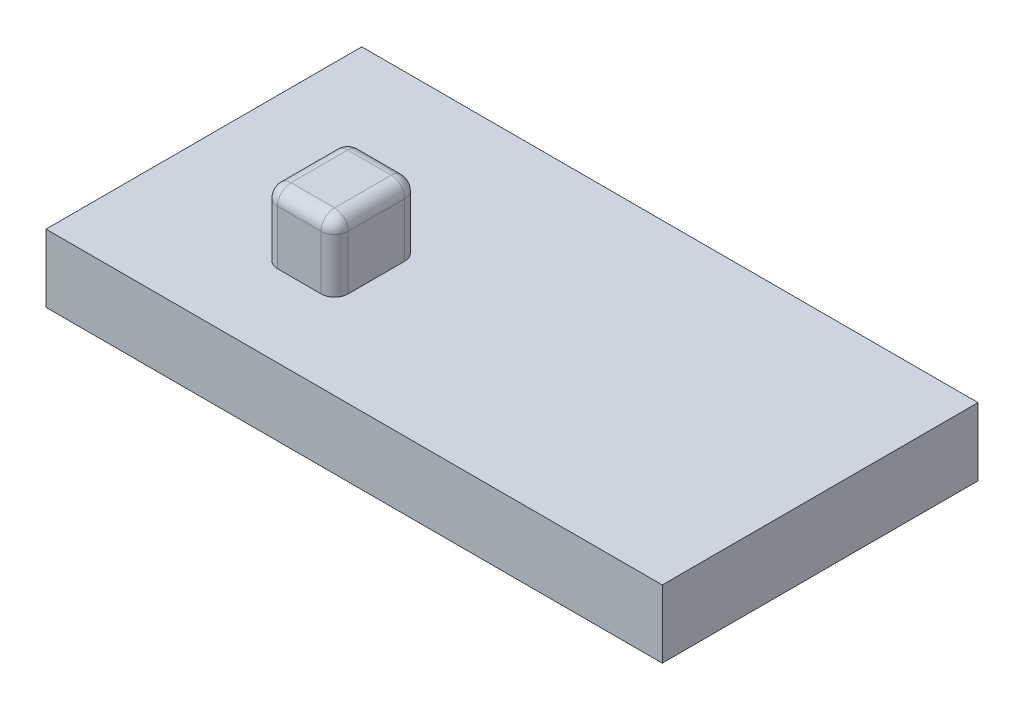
from build123d import *

# Parameters (mm, degrees)
SKETCH1_W      = 90.922172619
SKETCH1_H      = 46.585565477
EXTRUDE1_DEPTH = 10
SKETCH2_W      = 10.425791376
SKETCH2_H      = 12.340368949
EXTRUDE2_DEPTH = 10
FILLET1_R      = 2


with BuildPart() as part:
    # Sketch1 → Extrude1 (new body)
    with BuildSketch(Plane(origin=(0, 0, 0), x_dir=(1, 0, 0), z_dir=(0, 1, 0))):
        with Locations((-18.779592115, 8.192633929)):
            Rectangle(SKETCH1_W, SKETCH1_H)
    extrude(amount=EXTRUDE1_DEPTH)

    # Sketch2 → Extrude2 (add)
    with BuildSketch(Plane(origin=(0, 10, 0), x_dir=(1, 0, 0), z_dir=(0, 1, 0))):
        with Locations((-38.886782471, 3.083909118)):
            Rectangle(SKETCH2_W, SKETCH2_H)
    extrude(amount=EXTRUDE2_DEPTH)

    # Fillet1
    fillet1_edges = [part.edges().sort_by_distance(p)[0] for p in [
        (-44.099678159, 15, -9.254093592),
        (-44.099678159, 15, 3.086275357),
        (-33.673886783, 15, 3.086275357),
        (-33.673886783, 15, -9.254093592),
        (-44.099678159, 20, -3.083909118),
        (-38.886782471, 20, 3.086275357),
        (-33.673886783, 20, -3.083909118),
        (-38.886782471, 20, -9.254093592),
    ]]
    fillet(fillet1_edges, radius=FILLET1_R)


solid = part.part
